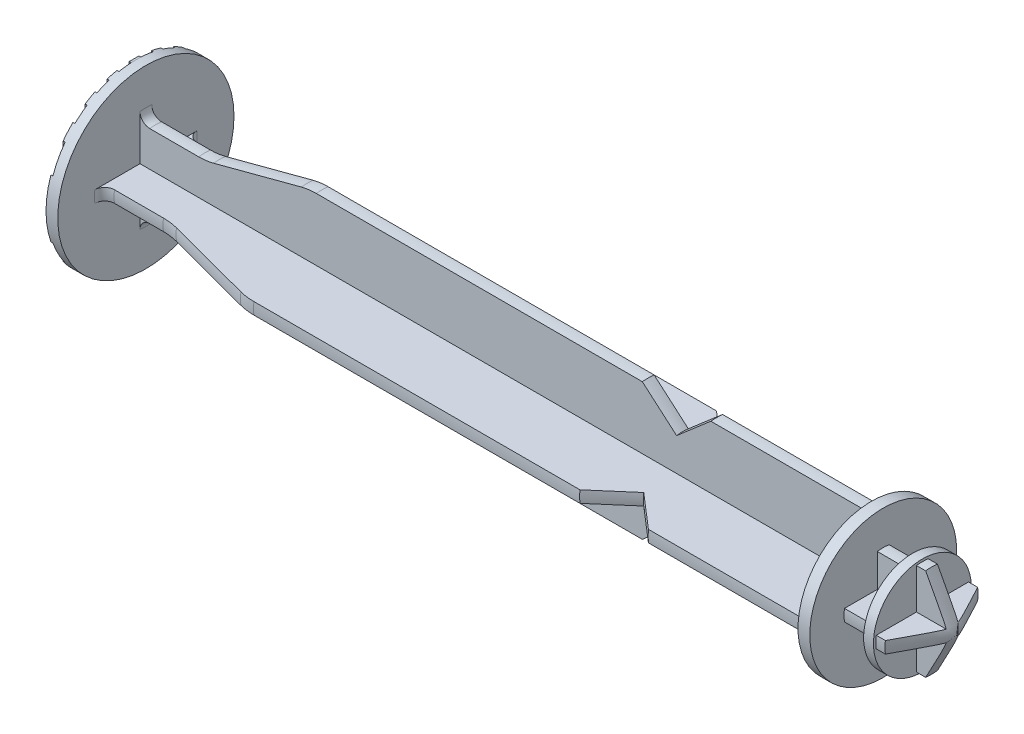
from build123d import *

# Parameters (mm, degrees)
SKETCH2_OUTSIDE_W   = 37.554
SKETCH2_OUTSIDE_H   = 37.554
CUT_EXTRUDE1_DEPTH  = 74.1
SKETCH3_OUTSIDE_W   = 37.554
SKETCH3_OUTSIDE_H   = 37.554
SKETCH3_OUTSIDE_W_2 = 1
SKETCH3_OUTSIDE_H_2 = 17.972200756
CUT_EXTRUDE2_DEPTH  = 0.2
SKETCH4_OUTSIDE_W   = 37.554
SKETCH4_OUTSIDE_H   = 37.554
CUT_EXTRUDE3_DEPTH  = 3
SKETCH5_OUTSIDE_W   = 37.554
SKETCH5_OUTSIDE_H   = 37.554
CUT_EXTRUDE4_DEPTH  = 3.5


with BuildPart() as part:
    # Sketch1 → Revolve1 (revolve)
    with BuildSketch(Plane.XY, mode=Mode.PRIVATE) as revolve1_sk:
        with BuildLine():
            Line((0, 0), (0, 9))
            Line((0, 9), (1.2, 9))
            Line((1.2, 9), (1.2, 5.25))
            ThreePointArc((1.2, 5.25), (1.492893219, 4.542893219), (2.2, 4.25))
            Line((2.2, 4.25), (7.2, 4.25))
            ThreePointArc((7.2, 4.25), (7.970049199, 4.299619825), (8.72736183, 4.44765859))
            Line((8.72736183, 4.44765859), (17.67263817, 6.80234141))
            ThreePointArc((17.67263817, 6.80234141), (18.429950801, 6.950380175), (19.2, 7))
            Line((19.2, 7), (52.5, 7))
            Line((52.5, 7), (56, 4))
            Line((56, 4), (59.5, 7))
            Line((59.5, 7), (75.3, 7))
            Line((75.3, 7), (75.3, 7.5))
            Line((75.3, 7.5), (76.5, 7.5))
            Line((76.5, 7.5), (76.5, 4))
            Line((76.5, 4), (79.5, 4))
            Line((79.5, 4), (79.5, 5))
            Line((79.5, 5), (81.3, 5))
            Line((81.3, 5), (84, 0))
            Line((84, 0), (0, 0))
        make_face()
    revolve(revolve1_sk.sketch.rotate(Axis((84, 0, 0), (-1, 0, 0)), 90), axis=Axis((84, 0, 0), (-1, 0, 0)))

    # Sketch2 outside → Cut-Extrude1 (cut)
    with BuildSketch(Plane(origin=(1.2, 0, 0), x_dir=(0, 0, -1), z_dir=(1, 0, 0))):
        Rectangle(SKETCH2_OUTSIDE_W, SKETCH2_OUTSIDE_H)
        with BuildLine():
            Line((-0.6, 8.979977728), (-0.6, 0.6))
            Line((-0.6, 0.6), (-8.979977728, 0.6))
            ThreePointArc((-8.979977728, 0.6), (-9, 0), (-8.979977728, -0.6))
            Line((-8.979977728, -0.6), (-0.6, -0.6))
            Line((-0.6, -0.6), (-0.6, -8.979977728))
            ThreePointArc((-0.6, -8.979977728), (0, -9), (0.6, -8.979977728))
            Line((0.6, -8.979977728), (0.6, -0.6))
            Line((0.6, -0.6), (8.979977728, -0.6))
            ThreePointArc((8.979977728, -0.6), (9, 0), (8.979977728, 0.6))
            Line((8.979977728, 0.6), (0.6, 0.6))
            Line((0.6, 0.6), (0.6, 8.979977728))
            ThreePointArc((0.6, 8.979977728), (0, 9), (-0.6, 8.979977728))
        make_face(mode=Mode.SUBTRACT)
    extrude(amount=CUT_EXTRUDE1_DEPTH, mode=Mode.SUBTRACT)

    # Sketch3 outside → Cut-Extrude2 (cut)
    with BuildSketch(Plane.ZY):
        Rectangle(SKETCH3_OUTSIDE_W, SKETCH3_OUTSIDE_H)
        with Locations((2.25, 0)):
            Rectangle(SKETCH3_OUTSIDE_W_2, SKETCH3_OUTSIDE_H_2, mode=Mode.SUBTRACT)
        Rectangle(SKETCH3_OUTSIDE_W_2, SKETCH3_OUTSIDE_H_2, mode=Mode.SUBTRACT)
        with Locations((4.5, 0)):
            Rectangle(SKETCH3_OUTSIDE_W_2, SKETCH3_OUTSIDE_H_2, mode=Mode.SUBTRACT)
        with Locations((6.75, 0)):
            Rectangle(SKETCH3_OUTSIDE_W_2, SKETCH3_OUTSIDE_H_2, mode=Mode.SUBTRACT)
        with Locations((9, 0)):
            Rectangle(SKETCH3_OUTSIDE_W_2, SKETCH3_OUTSIDE_H_2, mode=Mode.SUBTRACT)
        with Locations((11.25, 0)):
            Rectangle(SKETCH3_OUTSIDE_W_2, SKETCH3_OUTSIDE_H_2, mode=Mode.SUBTRACT)
        with Locations((13.5, 0)):
            Rectangle(SKETCH3_OUTSIDE_W_2, SKETCH3_OUTSIDE_H_2, mode=Mode.SUBTRACT)
        with Locations((-2.25, 0)):
            Rectangle(SKETCH3_OUTSIDE_W_2, SKETCH3_OUTSIDE_H_2, mode=Mode.SUBTRACT)
        with Locations((-4.5, 0)):
            Rectangle(SKETCH3_OUTSIDE_W_2, SKETCH3_OUTSIDE_H_2, mode=Mode.SUBTRACT)
        with Locations((-6.75, 0)):
            Rectangle(SKETCH3_OUTSIDE_W_2, SKETCH3_OUTSIDE_H_2, mode=Mode.SUBTRACT)
        with Locations((-9, 0)):
            Rectangle(SKETCH3_OUTSIDE_W_2, SKETCH3_OUTSIDE_H_2, mode=Mode.SUBTRACT)
        with Locations((-11.25, 0)):
            Rectangle(SKETCH3_OUTSIDE_W_2, SKETCH3_OUTSIDE_H_2, mode=Mode.SUBTRACT)
        with Locations((-13.5, 0)):
            Rectangle(SKETCH3_OUTSIDE_W_2, SKETCH3_OUTSIDE_H_2, mode=Mode.SUBTRACT)
    extrude(amount=-CUT_EXTRUDE2_DEPTH, mode=Mode.SUBTRACT)

    # Sketch4 outside → Cut-Extrude3 (cut)
    with BuildSketch(Plane(origin=(76.5, 0, 0), x_dir=(0, 0, -1), z_dir=(1, 0, 0))):
        Rectangle(SKETCH4_OUTSIDE_W, SKETCH4_OUTSIDE_H)
        with BuildLine():
            Line((0.6, 0.6), (0.6, 8.979977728))
            ThreePointArc((0.6, 8.979977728), (0, 9), (-0.6, 8.979977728))
            Line((-0.6, 8.979977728), (-0.6, 0.6))
            Line((-0.6, 0.6), (-8.979977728, 0.6))
            ThreePointArc((-8.979977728, 0.6), (-9, 0), (-8.979977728, -0.6))
            Line((-8.979977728, -0.6), (-0.6, -0.6))
            Line((-0.6, -0.6), (-0.6, -8.979977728))
            ThreePointArc((-0.6, -8.979977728), (0, -9), (0.6, -8.979977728))
            Line((0.6, -8.979977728), (0.6, -0.6))
            Line((0.6, -0.6), (8.979977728, -0.6))
            ThreePointArc((8.979977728, -0.6), (9, 0), (8.979977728, 0.6))
            Line((8.979977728, 0.6), (0.6, 0.6))
        make_face(mode=Mode.SUBTRACT)
    extrude(amount=CUT_EXTRUDE3_DEPTH, mode=Mode.SUBTRACT)

    # Sketch5 outside → Cut-Extrude4 (cut)
    with BuildSketch(Plane(origin=(84, 0, 0), x_dir=(0, 0, -1), z_dir=(1, 0, 0))):
        Rectangle(SKETCH5_OUTSIDE_W, SKETCH5_OUTSIDE_H)
        with BuildLine():
            Line((0.6, 0.6), (0.6, 4.711952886))
            ThreePointArc((0.6, 4.711952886), (0, 4.75), (-0.6, 4.711952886))
            Line((-0.6, 4.711952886), (-0.6, 0.6))
            Line((-0.6, 0.6), (-4.711952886, 0.6))
            ThreePointArc((-4.711952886, 0.6), (-4.75, 0), (-4.711952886, -0.6))
            Line((-4.711952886, -0.6), (-0.6, -0.6))
            Line((-0.6, -0.6), (-0.6, -4.711952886))
            ThreePointArc((-0.6, -4.711952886), (0, -4.75), (0.6, -4.711952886))
            Line((0.6, -4.711952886), (0.6, -0.6))
            Line((0.6, -0.6), (4.711952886, -0.6))
            ThreePointArc((4.711952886, -0.6), (4.75, 0), (4.711952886, 0.6))
            Line((4.711952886, 0.6), (0.6, 0.6))
        make_face(mode=Mode.SUBTRACT)
    extrude(amount=-CUT_EXTRUDE4_DEPTH, mode=Mode.SUBTRACT)


solid = part.part
